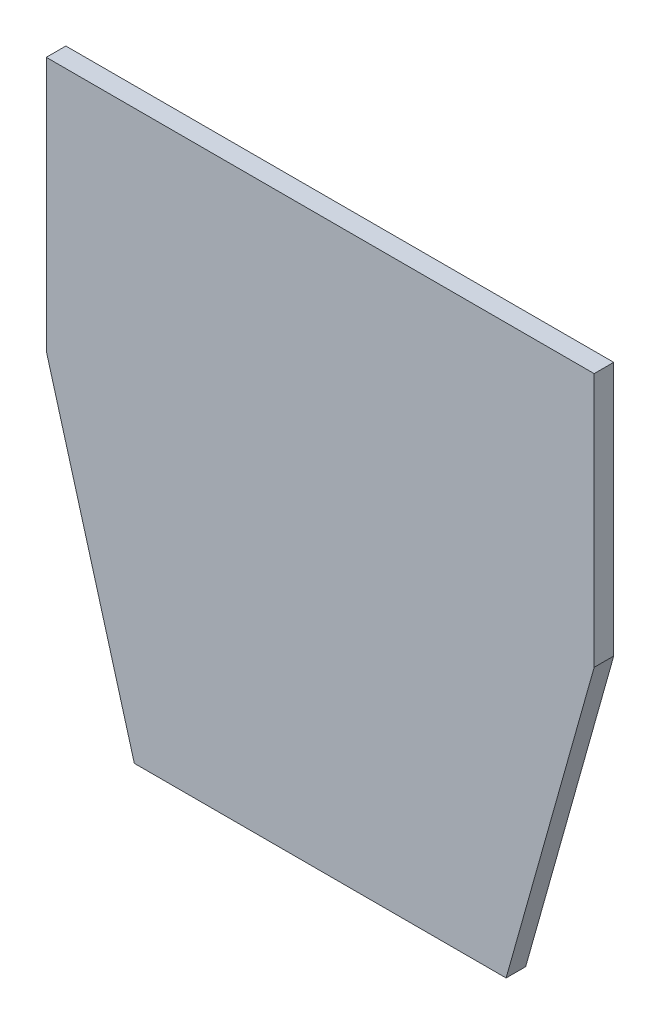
ISO-10303-21;
HEADER;
FILE_DESCRIPTION(('STEP AP214'),'2;1');
FILE_NAME('part.step','',(''),(''),'','','');
FILE_SCHEMA(('AUTOMOTIVE_DESIGN { 1 0 10303 214 1 1 1 1 }'));
ENDSEC;
DATA;
#1=APPLICATION_CONTEXT('core data for automotive mechanical design processes');
#2=APPLICATION_PROTOCOL_DEFINITION('international standard','automotive_design',2000,#1);
#3=PRODUCT_CONTEXT('',#1,'mechanical');
#4=PRODUCT('Part','Part','',(#3));
#5=PRODUCT_RELATED_PRODUCT_CATEGORY('part','',(#4));
#6=PRODUCT_DEFINITION_FORMATION('','',#4);
#7=PRODUCT_DEFINITION_CONTEXT('part definition',#1,'design');
#8=PRODUCT_DEFINITION('design','',#6,#7);
#9=PRODUCT_DEFINITION_SHAPE('','',#8);
#10=(LENGTH_UNIT() NAMED_UNIT(*) SI_UNIT(.MILLI.,.METRE.));
#11=(NAMED_UNIT(*) PLANE_ANGLE_UNIT() SI_UNIT($,.RADIAN.));
#12=(NAMED_UNIT(*) SI_UNIT($,.STERADIAN.) SOLID_ANGLE_UNIT());
#13=UNCERTAINTY_MEASURE_WITH_UNIT(LENGTH_MEASURE(1.E-05),#10,'distance_accuracy_value','');
#14=(GEOMETRIC_REPRESENTATION_CONTEXT(3) GLOBAL_UNCERTAINTY_ASSIGNED_CONTEXT((#13)) GLOBAL_UNIT_ASSIGNED_CONTEXT((#10,
#11,#12)) REPRESENTATION_CONTEXT('',''));
#15=CARTESIAN_POINT('',(0.,0.,0.));
#16=DIRECTION('',(0.,0.,1.));
#17=DIRECTION('',(1.,0.,0.));
#18=AXIS2_PLACEMENT_3D('',#15,#16,#17);
#19=CARTESIAN_POINT('',(95.,0.,10.));
#20=DIRECTION('',(-0.962650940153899,0.270745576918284,0.));
#21=DIRECTION('',(-0.270745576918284,-0.962650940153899,0.));
#22=AXIS2_PLACEMENT_3D('',#19,#20,#21);
#23=PLANE('',#22);
#24=DIRECTION('',(0.270745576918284,0.962650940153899,0.));
#25=VECTOR('',#24,1.);
#26=CARTESIAN_POINT('',(95.,0.,0.));
#27=LINE('',#26,#25);
#28=CARTESIAN_POINT('',(95.,0.,0.));
#29=VERTEX_POINT('',#28);
#30=CARTESIAN_POINT('',(140.,160.,0.));
#31=VERTEX_POINT('',#30);
#32=EDGE_CURVE('E115',#29,#31,#27,.T.);
#33=ORIENTED_EDGE('',*,*,#32,.T.);
#34=DIRECTION('',(0.,0.,-1.));
#35=VECTOR('',#34,1.);
#36=CARTESIAN_POINT('',(140.,160.,10.));
#37=LINE('',#36,#35);
#38=CARTESIAN_POINT('',(140.,160.,10.));
#39=VERTEX_POINT('',#38);
#40=EDGE_CURVE('E11',#39,#31,#37,.T.);
#41=ORIENTED_EDGE('',*,*,#40,.F.);
#42=DIRECTION('',(0.270745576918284,0.962650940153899,0.));
#43=VECTOR('',#42,1.);
#44=CARTESIAN_POINT('',(95.,0.,10.));
#45=LINE('',#44,#43);
#46=CARTESIAN_POINT('',(95.,0.,10.));
#47=VERTEX_POINT('',#46);
#48=EDGE_CURVE('E125',#47,#39,#45,.T.);
#49=ORIENTED_EDGE('',*,*,#48,.F.);
#50=DIRECTION('',(0.,0.,-1.));
#51=VECTOR('',#50,1.);
#52=CARTESIAN_POINT('',(95.,0.,10.));
#53=LINE('',#52,#51);
#54=EDGE_CURVE('E111',#47,#29,#53,.T.);
#55=ORIENTED_EDGE('',*,*,#54,.T.);
#56=EDGE_LOOP('',(#33,#41,#49,#55));
#57=FACE_BOUND('',#56,.T.);
#58=ADVANCED_FACE('F31',(#57),#23,.F.);
#59=CARTESIAN_POINT('',(140.,160.,10.));
#60=DIRECTION('',(-1.,0.,0.));
#61=DIRECTION('',(0.,0.,1.));
#62=AXIS2_PLACEMENT_3D('',#59,#60,#61);
#63=PLANE('',#62);
#64=DIRECTION('',(0.,1.,0.));
#65=VECTOR('',#64,1.);
#66=CARTESIAN_POINT('',(140.,160.,0.));
#67=LINE('',#66,#65);
#68=CARTESIAN_POINT('',(140.,290.,0.));
#69=VERTEX_POINT('',#68);
#70=EDGE_CURVE('E118',#31,#69,#67,.T.);
#71=ORIENTED_EDGE('',*,*,#70,.T.);
#72=DIRECTION('',(0.,0.,-1.));
#73=VECTOR('',#72,1.);
#74=CARTESIAN_POINT('',(140.,290.,10.));
#75=LINE('',#74,#73);
#76=CARTESIAN_POINT('',(140.,290.,10.));
#77=VERTEX_POINT('',#76);
#78=EDGE_CURVE('E39',#77,#69,#75,.T.);
#79=ORIENTED_EDGE('',*,*,#78,.F.);
#80=DIRECTION('',(0.,1.,0.));
#81=VECTOR('',#80,1.);
#82=CARTESIAN_POINT('',(140.,160.,10.));
#83=LINE('',#82,#81);
#84=EDGE_CURVE('E84',#39,#77,#83,.T.);
#85=ORIENTED_EDGE('',*,*,#84,.F.);
#86=ORIENTED_EDGE('',*,*,#40,.T.);
#87=EDGE_LOOP('',(#71,#79,#85,#86));
#88=FACE_BOUND('',#87,.T.);
#89=ADVANCED_FACE('F149',(#88),#63,.F.);
#90=CARTESIAN_POINT('',(140.,290.,10.));
#91=DIRECTION('',(0.,-1.,0.));
#92=DIRECTION('',(0.,0.,-1.));
#93=AXIS2_PLACEMENT_3D('',#90,#91,#92);
#94=PLANE('',#93);
#95=DIRECTION('',(-1.,0.,0.));
#96=VECTOR('',#95,1.);
#97=CARTESIAN_POINT('',(140.,290.,0.));
#98=LINE('',#97,#96);
#99=CARTESIAN_POINT('',(-140.,290.,0.));
#100=VERTEX_POINT('',#99);
#101=EDGE_CURVE('E120',#69,#100,#98,.T.);
#102=ORIENTED_EDGE('',*,*,#101,.T.);
#103=DIRECTION('',(0.,0.,-1.));
#104=VECTOR('',#103,1.);
#105=CARTESIAN_POINT('',(-140.,290.,10.));
#106=LINE('',#105,#104);
#107=CARTESIAN_POINT('',(-140.,290.,10.));
#108=VERTEX_POINT('',#107);
#109=EDGE_CURVE('E106',#108,#100,#106,.T.);
#110=ORIENTED_EDGE('',*,*,#109,.F.);
#111=DIRECTION('',(-1.,0.,0.));
#112=VECTOR('',#111,1.);
#113=CARTESIAN_POINT('',(140.,290.,10.));
#114=LINE('',#113,#112);
#115=EDGE_CURVE('E97',#77,#108,#114,.T.);
#116=ORIENTED_EDGE('',*,*,#115,.F.);
#117=ORIENTED_EDGE('',*,*,#78,.T.);
#118=EDGE_LOOP('',(#102,#110,#116,#117));
#119=FACE_BOUND('',#118,.T.);
#120=ADVANCED_FACE('F131',(#119),#94,.F.);
#121=CARTESIAN_POINT('',(-140.,160.,10.));
#122=DIRECTION('',(1.,0.,0.));
#123=DIRECTION('',(0.,0.,-1.));
#124=AXIS2_PLACEMENT_3D('',#121,#122,#123);
#125=PLANE('',#124);
#126=DIRECTION('',(0.,-1.,0.));
#127=VECTOR('',#126,1.);
#128=CARTESIAN_POINT('',(-140.,160.,0.));
#129=LINE('',#128,#127);
#130=CARTESIAN_POINT('',(-140.,160.,0.));
#131=VERTEX_POINT('',#130);
#132=EDGE_CURVE('E105',#100,#131,#129,.T.);
#133=ORIENTED_EDGE('',*,*,#132,.T.);
#134=DIRECTION('',(0.,0.,-1.));
#135=VECTOR('',#134,1.);
#136=CARTESIAN_POINT('',(-140.,160.,10.));
#137=LINE('',#136,#135);
#138=CARTESIAN_POINT('',(-140.,160.,10.));
#139=VERTEX_POINT('',#138);
#140=EDGE_CURVE('E102',#139,#131,#137,.T.);
#141=ORIENTED_EDGE('',*,*,#140,.F.);
#142=DIRECTION('',(0.,-1.,0.));
#143=VECTOR('',#142,1.);
#144=CARTESIAN_POINT('',(-140.,160.,10.));
#145=LINE('',#144,#143);
#146=EDGE_CURVE('E91',#108,#139,#145,.T.);
#147=ORIENTED_EDGE('',*,*,#146,.F.);
#148=ORIENTED_EDGE('',*,*,#109,.T.);
#149=EDGE_LOOP('',(#133,#141,#147,#148));
#150=FACE_BOUND('',#149,.T.);
#151=ADVANCED_FACE('F103',(#150),#125,.F.);
#152=CARTESIAN_POINT('',(-95.,0.,10.));
#153=DIRECTION('',(0.962650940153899,0.270745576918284,0.));
#154=DIRECTION('',(-0.270745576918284,0.962650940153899,0.));
#155=AXIS2_PLACEMENT_3D('',#152,#153,#154);
#156=PLANE('',#155);
#157=DIRECTION('',(0.270745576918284,-0.962650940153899,0.));
#158=VECTOR('',#157,1.);
#159=CARTESIAN_POINT('',(-95.,0.,0.));
#160=LINE('',#159,#158);
#161=CARTESIAN_POINT('',(-95.,0.,0.));
#162=VERTEX_POINT('',#161);
#163=EDGE_CURVE('E70',#131,#162,#160,.T.);
#164=ORIENTED_EDGE('',*,*,#163,.T.);
#165=DIRECTION('',(0.,0.,-1.));
#166=VECTOR('',#165,1.);
#167=CARTESIAN_POINT('',(-95.,0.,10.));
#168=LINE('',#167,#166);
#169=CARTESIAN_POINT('',(-95.,0.,10.));
#170=VERTEX_POINT('',#169);
#171=EDGE_CURVE('E107',#170,#162,#168,.T.);
#172=ORIENTED_EDGE('',*,*,#171,.F.);
#173=DIRECTION('',(0.270745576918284,-0.962650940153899,0.));
#174=VECTOR('',#173,1.);
#175=CARTESIAN_POINT('',(-95.,0.,10.));
#176=LINE('',#175,#174);
#177=EDGE_CURVE('E95',#139,#170,#176,.T.);
#178=ORIENTED_EDGE('',*,*,#177,.F.);
#179=ORIENTED_EDGE('',*,*,#140,.T.);
#180=EDGE_LOOP('',(#164,#172,#178,#179));
#181=FACE_BOUND('',#180,.T.);
#182=ADVANCED_FACE('F109',(#181),#156,.F.);
#183=CARTESIAN_POINT('',(-95.,0.,10.));
#184=DIRECTION('',(0.,1.,0.));
#185=DIRECTION('',(0.,0.,1.));
#186=AXIS2_PLACEMENT_3D('',#183,#184,#185);
#187=PLANE('',#186);
#188=DIRECTION('',(1.,0.,0.));
#189=VECTOR('',#188,1.);
#190=CARTESIAN_POINT('',(-95.,0.,0.));
#191=LINE('',#190,#189);
#192=EDGE_CURVE('E76',#162,#29,#191,.T.);
#193=ORIENTED_EDGE('',*,*,#192,.T.);
#194=ORIENTED_EDGE('',*,*,#54,.F.);
#195=DIRECTION('',(1.,0.,0.));
#196=VECTOR('',#195,1.);
#197=CARTESIAN_POINT('',(-95.,0.,10.));
#198=LINE('',#197,#196);
#199=EDGE_CURVE('E47',#170,#47,#198,.T.);
#200=ORIENTED_EDGE('',*,*,#199,.F.);
#201=ORIENTED_EDGE('',*,*,#171,.T.);
#202=EDGE_LOOP('',(#193,#194,#200,#201));
#203=FACE_BOUND('',#202,.T.);
#204=ADVANCED_FACE('F138',(#203),#187,.F.);
#205=CARTESIAN_POINT('',(176.5625,290.,10.));
#206=DIRECTION('',(0.,0.,1.));
#207=DIRECTION('',(1.,0.,0.));
#208=AXIS2_PLACEMENT_3D('',#205,#206,#207);
#209=PLANE('',#208);
#210=ORIENTED_EDGE('',*,*,#48,.T.);
#211=ORIENTED_EDGE('',*,*,#84,.T.);
#212=ORIENTED_EDGE('',*,*,#115,.T.);
#213=ORIENTED_EDGE('',*,*,#146,.T.);
#214=ORIENTED_EDGE('',*,*,#177,.T.);
#215=ORIENTED_EDGE('',*,*,#199,.T.);
#216=EDGE_LOOP('',(#210,#211,#212,#213,#214,#215));
#217=FACE_BOUND('',#216,.T.);
#218=ADVANCED_FACE('F93',(#217),#209,.T.);
#219=CARTESIAN_POINT('',(176.5625,290.,0.));
#220=DIRECTION('',(0.,0.,1.));
#221=DIRECTION('',(1.,0.,0.));
#222=AXIS2_PLACEMENT_3D('',#219,#220,#221);
#223=PLANE('',#222);
#224=ORIENTED_EDGE('',*,*,#32,.F.);
#225=ORIENTED_EDGE('',*,*,#192,.F.);
#226=ORIENTED_EDGE('',*,*,#163,.F.);
#227=ORIENTED_EDGE('',*,*,#132,.F.);
#228=ORIENTED_EDGE('',*,*,#101,.F.);
#229=ORIENTED_EDGE('',*,*,#70,.F.);
#230=EDGE_LOOP('',(#224,#225,#226,#227,#228,#229));
#231=FACE_BOUND('',#230,.T.);
#232=ADVANCED_FACE('F134',(#231),#223,.F.);
#233=CLOSED_SHELL('',(#58,#89,#120,#151,#182,#204,#218,#232));
#234=MANIFOLD_SOLID_BREP('B2',#233);
#235=ADVANCED_BREP_SHAPE_REPRESENTATION('',(#18,#234),#14);
#236=SHAPE_DEFINITION_REPRESENTATION(#9,#235);
ENDSEC;
END-ISO-10303-21;
